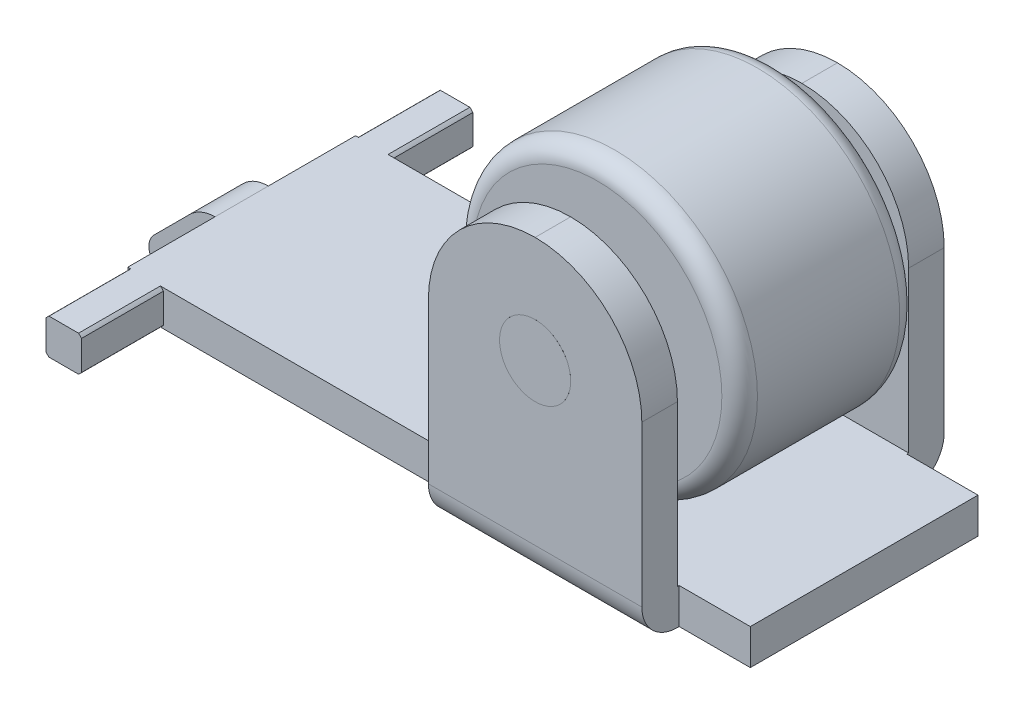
ISO-10303-21;
HEADER;
FILE_DESCRIPTION(('STEP AP214'),'2;1');
FILE_NAME('part.step','',(''),(''),'','','');
FILE_SCHEMA(('AUTOMOTIVE_DESIGN { 1 0 10303 214 1 1 1 1 }'));
ENDSEC;
DATA;
#1=APPLICATION_CONTEXT('core data for automotive mechanical design processes');
#2=APPLICATION_PROTOCOL_DEFINITION('international standard','automotive_design',2000,#1);
#3=PRODUCT_CONTEXT('',#1,'mechanical');
#4=PRODUCT('Part','Part','',(#3));
#5=PRODUCT_RELATED_PRODUCT_CATEGORY('part','',(#4));
#6=PRODUCT_DEFINITION_FORMATION('','',#4);
#7=PRODUCT_DEFINITION_CONTEXT('part definition',#1,'design');
#8=PRODUCT_DEFINITION('design','',#6,#7);
#9=PRODUCT_DEFINITION_SHAPE('','',#8);
#10=(LENGTH_UNIT() NAMED_UNIT(*) SI_UNIT(.MILLI.,.METRE.));
#11=(NAMED_UNIT(*) PLANE_ANGLE_UNIT() SI_UNIT($,.RADIAN.));
#12=(NAMED_UNIT(*) SI_UNIT($,.STERADIAN.) SOLID_ANGLE_UNIT());
#13=UNCERTAINTY_MEASURE_WITH_UNIT(LENGTH_MEASURE(1.E-05),#10,'distance_accuracy_value','');
#14=(GEOMETRIC_REPRESENTATION_CONTEXT(3) GLOBAL_UNCERTAINTY_ASSIGNED_CONTEXT((#13)) GLOBAL_UNIT_ASSIGNED_CONTEXT((#10,
#11,#12)) REPRESENTATION_CONTEXT('',''));
#15=CARTESIAN_POINT('',(0.,0.,0.));
#16=DIRECTION('',(0.,0.,1.));
#17=DIRECTION('',(1.,0.,0.));
#18=AXIS2_PLACEMENT_3D('',#15,#16,#17);
#19=CARTESIAN_POINT('',(12.,5.,2.5));
#20=DIRECTION('',(0.,0.,1.));
#21=DIRECTION('',(1.,0.,0.));
#22=AXIS2_PLACEMENT_3D('',#19,#20,#21);
#23=PLANE('',#22);
#24=CARTESIAN_POINT('',(12.,5.,2.5));
#25=DIRECTION('',(0.,0.,1.));
#26=DIRECTION('',(1.,0.,0.));
#27=AXIS2_PLACEMENT_3D('',#24,#25,#26);
#28=CIRCLE('',#27,3.50000000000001);
#29=CARTESIAN_POINT('',(15.5,5.,2.5));
#30=VERTEX_POINT('',#29);
#31=EDGE_CURVE('E58',#30,#30,#28,.T.);
#32=ORIENTED_EDGE('',*,*,#31,.T.);
#33=EDGE_LOOP('',(#32));
#34=FACE_BOUND('',#33,.T.);
#35=CARTESIAN_POINT('',(12.,5.,2.5));
#36=DIRECTION('',(0.,0.,1.));
#37=DIRECTION('',(1.,0.,0.));
#38=AXIS2_PLACEMENT_3D('',#35,#36,#37);
#39=CIRCLE('',#38,1.);
#40=CARTESIAN_POINT('',(13.,5.,2.5));
#41=VERTEX_POINT('',#40);
#42=EDGE_CURVE('E63',#41,#41,#39,.T.);
#43=ORIENTED_EDGE('',*,*,#42,.F.);
#44=EDGE_LOOP('',(#43));
#45=FACE_BOUND('',#44,.T.);
#46=ADVANCED_FACE('F43',(#34,#45),#23,.T.);
#47=CARTESIAN_POINT('',(12.,5.,-2.5));
#48=DIRECTION('',(0.,0.,1.));
#49=DIRECTION('',(1.,0.,0.));
#50=AXIS2_PLACEMENT_3D('',#47,#48,#49);
#51=PLANE('',#50);
#52=CARTESIAN_POINT('',(12.,5.,-2.5));
#53=DIRECTION('',(0.,0.,1.));
#54=DIRECTION('',(1.,0.,0.));
#55=AXIS2_PLACEMENT_3D('',#52,#53,#54);
#56=CIRCLE('',#55,3.50000000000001);
#57=CARTESIAN_POINT('',(15.5,5.,-2.5));
#58=VERTEX_POINT('',#57);
#59=EDGE_CURVE('E13',#58,#58,#56,.F.);
#60=ORIENTED_EDGE('',*,*,#59,.T.);
#61=EDGE_LOOP('',(#60));
#62=FACE_BOUND('',#61,.T.);
#63=CARTESIAN_POINT('',(12.,5.,-2.5));
#64=DIRECTION('',(0.,0.,1.));
#65=DIRECTION('',(1.,0.,0.));
#66=AXIS2_PLACEMENT_3D('',#63,#64,#65);
#67=CIRCLE('',#66,1.);
#68=CARTESIAN_POINT('',(13.,5.,-2.5));
#69=VERTEX_POINT('',#68);
#70=EDGE_CURVE('E64',#69,#69,#67,.T.);
#71=ORIENTED_EDGE('',*,*,#70,.T.);
#72=EDGE_LOOP('',(#71));
#73=FACE_BOUND('',#72,.T.);
#74=ADVANCED_FACE('F74',(#62,#73),#51,.F.);
#75=CARTESIAN_POINT('',(12.,5.,2.5));
#76=DIRECTION('',(0.,0.,-1.));
#77=DIRECTION('',(-1.,0.,0.));
#78=AXIS2_PLACEMENT_3D('',#75,#76,#77);
#79=CYLINDRICAL_SURFACE('',#78,4.00000000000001);
#80=CARTESIAN_POINT('',(12.,5.,2.));
#81=DIRECTION('',(0.,0.,1.));
#82=DIRECTION('',(1.,0.,0.));
#83=AXIS2_PLACEMENT_3D('',#80,#81,#82);
#84=CIRCLE('',#83,4.00000000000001);
#85=CARTESIAN_POINT('',(16.,5.,2.));
#86=VERTEX_POINT('',#85);
#87=EDGE_CURVE('E50',#86,#86,#84,.F.);
#88=ORIENTED_EDGE('',*,*,#87,.T.);
#89=EDGE_LOOP('',(#88));
#90=FACE_BOUND('',#89,.T.);
#91=CARTESIAN_POINT('',(12.,5.,-2.));
#92=DIRECTION('',(0.,0.,1.));
#93=DIRECTION('',(1.,0.,0.));
#94=AXIS2_PLACEMENT_3D('',#91,#92,#93);
#95=CIRCLE('',#94,4.00000000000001);
#96=CARTESIAN_POINT('',(16.,5.,-2.));
#97=VERTEX_POINT('',#96);
#98=EDGE_CURVE('E54',#97,#97,#95,.T.);
#99=ORIENTED_EDGE('',*,*,#98,.T.);
#100=EDGE_LOOP('',(#99));
#101=FACE_BOUND('',#100,.T.);
#102=ADVANCED_FACE('F80',(#90,#101),#79,.T.);
#103=CARTESIAN_POINT('',(12.,5.,2.5));
#104=DIRECTION('',(0.,0.,-1.));
#105=DIRECTION('',(-1.,0.,0.));
#106=AXIS2_PLACEMENT_3D('',#103,#104,#105);
#107=CYLINDRICAL_SURFACE('',#106,1.);
#108=ORIENTED_EDGE('',*,*,#42,.T.);
#109=EDGE_LOOP('',(#108));
#110=FACE_BOUND('',#109,.T.);
#111=ORIENTED_EDGE('',*,*,#70,.F.);
#112=EDGE_LOOP('',(#111));
#113=FACE_BOUND('',#112,.T.);
#114=ADVANCED_FACE('F70',(#110,#113),#107,.F.);
#115=CARTESIAN_POINT('',(12.,5.,2.));
#116=DIRECTION('',(0.,0.,1.));
#117=DIRECTION('',(1.,0.,0.));
#118=AXIS2_PLACEMENT_3D('',#115,#116,#117);
#119=TOROIDAL_SURFACE('',#118,3.50000000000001,0.5);
#120=ORIENTED_EDGE('',*,*,#87,.F.);
#121=EDGE_LOOP('',(#120));
#122=FACE_BOUND('',#121,.T.);
#123=ORIENTED_EDGE('',*,*,#31,.F.);
#124=EDGE_LOOP('',(#123));
#125=FACE_BOUND('',#124,.T.);
#126=ADVANCED_FACE('F85',(#122,#125),#119,.T.);
#127=CARTESIAN_POINT('',(12.,5.,-2.));
#128=DIRECTION('',(0.,0.,1.));
#129=DIRECTION('',(1.,0.,0.));
#130=AXIS2_PLACEMENT_3D('',#127,#128,#129);
#131=TOROIDAL_SURFACE('',#130,3.50000000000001,0.5);
#132=ORIENTED_EDGE('',*,*,#59,.F.);
#133=EDGE_LOOP('',(#132));
#134=FACE_BOUND('',#133,.T.);
#135=ORIENTED_EDGE('',*,*,#98,.F.);
#136=EDGE_LOOP('',(#135));
#137=FACE_BOUND('',#136,.T.);
#138=ADVANCED_FACE('F45',(#134,#137),#131,.T.);
#139=CLOSED_SHELL('',(#46,#74,#102,#114,#126,#138));
#140=MANIFOLD_SOLID_BREP('B2',#139);
#141=CARTESIAN_POINT('',(9.,8.,4.25));
#142=DIRECTION('',(0.,0.,1.));
#143=DIRECTION('',(0.,-1.,0.));
#144=AXIS2_PLACEMENT_3D('',#141,#142,#143);
#145=PLANE('',#144);
#146=CARTESIAN_POINT('',(12.,5.,4.25));
#147=DIRECTION('',(0.,0.,1.));
#148=DIRECTION('',(0.,-1.,0.));
#149=AXIS2_PLACEMENT_3D('',#146,#147,#148);
#150=CIRCLE('',#149,1.);
#151=CARTESIAN_POINT('',(12.,3.99999999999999,4.25));
#152=VERTEX_POINT('',#151);
#153=EDGE_CURVE('E42',#152,#152,#150,.F.);
#154=ORIENTED_EDGE('',*,*,#153,.F.);
#155=EDGE_LOOP('',(#154));
#156=FACE_BOUND('',#155,.T.);
#157=ADVANCED_FACE('F144',(#156),#145,.T.);
#158=CARTESIAN_POINT('',(12.,5.,-4.25));
#159=DIRECTION('',(0.,0.,-1.));
#160=DIRECTION('',(0.,1.,0.));
#161=AXIS2_PLACEMENT_3D('',#158,#159,#160);
#162=PLANE('',#161);
#163=CARTESIAN_POINT('',(12.,5.,-4.25));
#164=DIRECTION('',(0.,0.,-1.));
#165=DIRECTION('',(0.,1.,0.));
#166=AXIS2_PLACEMENT_3D('',#163,#164,#165);
#167=CIRCLE('',#166,1.);
#168=CARTESIAN_POINT('',(12.,6.,-4.25));
#169=VERTEX_POINT('',#168);
#170=EDGE_CURVE('E150',#169,#169,#167,.T.);
#171=ORIENTED_EDGE('',*,*,#170,.T.);
#172=EDGE_LOOP('',(#171));
#173=FACE_BOUND('',#172,.T.);
#174=ADVANCED_FACE('F156',(#173),#162,.T.);
#175=CARTESIAN_POINT('',(12.,5.,7.07842712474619));
#176=DIRECTION('',(0.,0.,-1.));
#177=DIRECTION('',(0.,1.,0.));
#178=AXIS2_PLACEMENT_3D('',#175,#176,#177);
#179=CYLINDRICAL_SURFACE('',#178,1.);
#180=ORIENTED_EDGE('',*,*,#170,.F.);
#181=EDGE_LOOP('',(#180));
#182=FACE_BOUND('',#181,.T.);
#183=ORIENTED_EDGE('',*,*,#153,.T.);
#184=EDGE_LOOP('',(#183));
#185=FACE_BOUND('',#184,.T.);
#186=ADVANCED_FACE('F158',(#182,#185),#179,.T.);
#187=CLOSED_SHELL('',(#157,#174,#186));
#188=MANIFOLD_SOLID_BREP('B8',#187);
#189=CARTESIAN_POINT('',(17.,-0.5,-3.2));
#190=DIRECTION('',(0.,0.,-1.));
#191=DIRECTION('',(-1.,0.,0.));
#192=AXIS2_PLACEMENT_3D('',#189,#190,#191);
#193=PLANE('',#192);
#194=DIRECTION('',(1.,0.,0.));
#195=VECTOR('',#194,1.);
#196=CARTESIAN_POINT('',(-0.5,-0.5,-3.2));
#197=LINE('',#196,#195);
#198=CARTESIAN_POINT('',(15.,-0.5,-3.2));
#199=VERTEX_POINT('',#198);
#200=CARTESIAN_POINT('',(17.,-0.5,-3.2));
#201=VERTEX_POINT('',#200);
#202=EDGE_CURVE('E480',#199,#201,#197,.T.);
#203=ORIENTED_EDGE('',*,*,#202,.F.);
#204=DIRECTION('',(0.,-1.,0.));
#205=VECTOR('',#204,1.);
#206=CARTESIAN_POINT('',(15.,0.5,-3.2));
#207=LINE('',#206,#205);
#208=CARTESIAN_POINT('',(15.,0.5,-3.2));
#209=VERTEX_POINT('',#208);
#210=EDGE_CURVE('E1324',#209,#199,#207,.T.);
#211=ORIENTED_EDGE('',*,*,#210,.F.);
#212=DIRECTION('',(-1.,0.,0.));
#213=VECTOR('',#212,1.);
#214=CARTESIAN_POINT('',(0.,0.5,-3.2));
#215=LINE('',#214,#213);
#216=CARTESIAN_POINT('',(17.,0.5,-3.2));
#217=VERTEX_POINT('',#216);
#218=EDGE_CURVE('E476',#217,#209,#215,.T.);
#219=ORIENTED_EDGE('',*,*,#218,.F.);
#220=DIRECTION('',(0.,1.,0.));
#221=VECTOR('',#220,1.);
#222=CARTESIAN_POINT('',(17.,0.5,-3.2));
#223=LINE('',#222,#221);
#224=EDGE_CURVE('E477',#201,#217,#223,.T.);
#225=ORIENTED_EDGE('',*,*,#224,.F.);
#226=EDGE_LOOP('',(#203,#211,#219,#225));
#227=FACE_BOUND('',#226,.T.);
#228=ADVANCED_FACE('F185',(#227),#193,.T.);
#229=CARTESIAN_POINT('',(17.,-0.5,3.2));
#230=DIRECTION('',(0.,0.,-1.));
#231=DIRECTION('',(-1.,0.,0.));
#232=AXIS2_PLACEMENT_3D('',#229,#230,#231);
#233=PLANE('',#232);
#234=DIRECTION('',(0.,1.,0.));
#235=VECTOR('',#234,1.);
#236=CARTESIAN_POINT('',(9.,0.5,3.2));
#237=LINE('',#236,#235);
#238=CARTESIAN_POINT('',(9.,-0.5,3.2));
#239=VERTEX_POINT('',#238);
#240=CARTESIAN_POINT('',(9.,0.5,3.2));
#241=VERTEX_POINT('',#240);
#242=EDGE_CURVE('E626',#239,#241,#237,.T.);
#243=ORIENTED_EDGE('',*,*,#242,.T.);
#244=DIRECTION('',(-1.,0.,0.));
#245=VECTOR('',#244,1.);
#246=CARTESIAN_POINT('',(0.,0.5,3.2));
#247=LINE('',#246,#245);
#248=CARTESIAN_POINT('',(0.415331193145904,0.5,3.2));
#249=VERTEX_POINT('',#248);
#250=EDGE_CURVE('E677',#241,#249,#247,.T.);
#251=ORIENTED_EDGE('',*,*,#250,.T.);
#252=CARTESIAN_POINT('',(0.,0.,3.2));
#253=DIRECTION('',(0.,0.,-1.));
#254=DIRECTION('',(-1.,0.,0.));
#255=AXIS2_PLACEMENT_3D('',#252,#253,#254);
#256=CIRCLE('',#255,0.65);
#257=CARTESIAN_POINT('',(0.5,0.415331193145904,3.2));
#258=VERTEX_POINT('',#257);
#259=EDGE_CURVE('E926',#258,#249,#256,.F.);
#260=ORIENTED_EDGE('',*,*,#259,.F.);
#261=DIRECTION('',(0.,1.,0.));
#262=VECTOR('',#261,1.);
#263=CARTESIAN_POINT('',(0.5,-0.500000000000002,3.2));
#264=LINE('',#263,#262);
#265=CARTESIAN_POINT('',(0.5,-0.415331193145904,3.2));
#266=VERTEX_POINT('',#265);
#267=EDGE_CURVE('E482',#266,#258,#264,.T.);
#268=ORIENTED_EDGE('',*,*,#267,.F.);
#269=CARTESIAN_POINT('',(0.415331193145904,-0.5,3.2));
#270=VERTEX_POINT('',#269);
#271=EDGE_CURVE('E736',#270,#266,#256,.F.);
#272=ORIENTED_EDGE('',*,*,#271,.F.);
#273=DIRECTION('',(1.,0.,0.));
#274=VECTOR('',#273,1.);
#275=CARTESIAN_POINT('',(0.,-0.5,3.2));
#276=LINE('',#275,#274);
#277=EDGE_CURVE('E666',#270,#239,#276,.T.);
#278=ORIENTED_EDGE('',*,*,#277,.T.);
#279=EDGE_LOOP('',(#243,#251,#260,#268,#272,#278));
#280=FACE_BOUND('',#279,.T.);
#281=ADVANCED_FACE('F876',(#280),#233,.F.);
#282=CARTESIAN_POINT('',(-0.5,0.5,3.2));
#283=DIRECTION('',(1.,0.,0.));
#284=DIRECTION('',(0.,0.,-1.));
#285=AXIS2_PLACEMENT_3D('',#282,#283,#284);
#286=PLANE('',#285);
#287=DIRECTION('',(0.,1.,0.));
#288=VECTOR('',#287,1.);
#289=CARTESIAN_POINT('',(-0.5,0.5,0.75));
#290=LINE('',#289,#288);
#291=CARTESIAN_POINT('',(-0.5,-0.5,0.75));
#292=VERTEX_POINT('',#291);
#293=CARTESIAN_POINT('',(-0.5,0.5,0.75));
#294=VERTEX_POINT('',#293);
#295=EDGE_CURVE('E530',#292,#294,#290,.T.);
#296=ORIENTED_EDGE('',*,*,#295,.F.);
#297=DIRECTION('',(0.,0.,-1.));
#298=VECTOR('',#297,1.);
#299=CARTESIAN_POINT('',(-0.5,-0.5,3.2));
#300=LINE('',#299,#298);
#301=CARTESIAN_POINT('',(-0.5,-0.5,3.2));
#302=VERTEX_POINT('',#301);
#303=EDGE_CURVE('E498',#302,#292,#300,.T.);
#304=ORIENTED_EDGE('',*,*,#303,.F.);
#305=DIRECTION('',(0.,1.,0.));
#306=VECTOR('',#305,1.);
#307=CARTESIAN_POINT('',(-0.5,0.5,3.2));
#308=LINE('',#307,#306);
#309=CARTESIAN_POINT('',(-0.5,-0.415331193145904,3.2));
#310=VERTEX_POINT('',#309);
#311=EDGE_CURVE('E708',#302,#310,#308,.T.);
#312=ORIENTED_EDGE('',*,*,#311,.T.);
#313=DIRECTION('',(0.,0.,1.));
#314=VECTOR('',#313,1.);
#315=CARTESIAN_POINT('',(-0.5,-0.415331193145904,-14.6813898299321));
#316=LINE('',#315,#314);
#317=CARTESIAN_POINT('',(-0.5,-0.415331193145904,5.5));
#318=VERTEX_POINT('',#317);
#319=EDGE_CURVE('E723',#318,#310,#316,.F.);
#320=ORIENTED_EDGE('',*,*,#319,.F.);
#321=DIRECTION('',(0.,-1.,0.));
#322=VECTOR('',#321,1.);
#323=CARTESIAN_POINT('',(-0.5,0.5,5.5));
#324=LINE('',#323,#322);
#325=CARTESIAN_POINT('',(-0.5,0.415331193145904,5.5));
#326=VERTEX_POINT('',#325);
#327=EDGE_CURVE('E703',#326,#318,#324,.T.);
#328=ORIENTED_EDGE('',*,*,#327,.F.);
#329=DIRECTION('',(0.,0.,1.));
#330=VECTOR('',#329,1.);
#331=CARTESIAN_POINT('',(-0.5,0.415331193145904,-14.6813898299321));
#332=LINE('',#331,#330);
#333=CARTESIAN_POINT('',(-0.5,0.415331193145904,3.2));
#334=VERTEX_POINT('',#333);
#335=EDGE_CURVE('E721',#334,#326,#332,.T.);
#336=ORIENTED_EDGE('',*,*,#335,.F.);
#337=CARTESIAN_POINT('',(-0.5,0.5,3.2));
#338=VERTEX_POINT('',#337);
#339=EDGE_CURVE('E711',#334,#338,#308,.T.);
#340=ORIENTED_EDGE('',*,*,#339,.T.);
#341=DIRECTION('',(0.,0.,-1.));
#342=VECTOR('',#341,1.);
#343=CARTESIAN_POINT('',(-0.5,0.5,3.2));
#344=LINE('',#343,#342);
#345=EDGE_CURVE('E518',#338,#294,#344,.T.);
#346=ORIENTED_EDGE('',*,*,#345,.T.);
#347=EDGE_LOOP('',(#296,#304,#312,#320,#328,#336,#340,#346));
#348=FACE_BOUND('',#347,.T.);
#349=ADVANCED_FACE('F815',(#348),#286,.F.);
#350=CARTESIAN_POINT('',(0.,0.5,3.2));
#351=DIRECTION('',(0.,-1.,0.));
#352=DIRECTION('',(0.,0.,-1.));
#353=AXIS2_PLACEMENT_3D('',#350,#351,#352);
#354=PLANE('',#353);
#355=DIRECTION('',(0.,0.,-1.));
#356=VECTOR('',#355,1.);
#357=CARTESIAN_POINT('',(-0.415331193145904,0.5,14.6813898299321));
#358=LINE('',#357,#356);
#359=CARTESIAN_POINT('',(-0.415331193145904,0.5,-3.2));
#360=VERTEX_POINT('',#359);
#361=CARTESIAN_POINT('',(-0.415331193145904,0.5,-5.5));
#362=VERTEX_POINT('',#361);
#363=EDGE_CURVE('E741',#360,#362,#358,.T.);
#364=ORIENTED_EDGE('',*,*,#363,.F.);
#365=DIRECTION('',(1.,0.,0.));
#366=VECTOR('',#365,1.);
#367=CARTESIAN_POINT('',(0.,0.5,-3.2));
#368=LINE('',#367,#366);
#369=CARTESIAN_POINT('',(-0.5,0.5,-3.2));
#370=VERTEX_POINT('',#369);
#371=EDGE_CURVE('E753',#370,#360,#368,.T.);
#372=ORIENTED_EDGE('',*,*,#371,.F.);
#373=CARTESIAN_POINT('',(-0.5,0.5,-0.75));
#374=VERTEX_POINT('',#373);
#375=EDGE_CURVE('E501',#374,#370,#344,.T.);
#376=ORIENTED_EDGE('',*,*,#375,.F.);
#377=DIRECTION('',(0.,0.,-1.));
#378=VECTOR('',#377,1.);
#379=CARTESIAN_POINT('',(-0.5,0.5,0.75));
#380=LINE('',#379,#378);
#381=EDGE_CURVE('E537',#294,#374,#380,.T.);
#382=ORIENTED_EDGE('',*,*,#381,.F.);
#383=ORIENTED_EDGE('',*,*,#345,.F.);
#384=DIRECTION('',(1.,0.,0.));
#385=VECTOR('',#384,1.);
#386=CARTESIAN_POINT('',(0.,0.5,3.2));
#387=LINE('',#386,#385);
#388=CARTESIAN_POINT('',(-0.415331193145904,0.5,3.2));
#389=VERTEX_POINT('',#388);
#390=EDGE_CURVE('E697',#338,#389,#387,.T.);
#391=ORIENTED_EDGE('',*,*,#390,.T.);
#392=DIRECTION('',(0.,0.,1.));
#393=VECTOR('',#392,1.);
#394=CARTESIAN_POINT('',(-0.415331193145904,0.5,-14.6813898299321));
#395=LINE('',#394,#393);
#396=CARTESIAN_POINT('',(-0.415331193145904,0.5,5.5));
#397=VERTEX_POINT('',#396);
#398=EDGE_CURVE('E719',#397,#389,#395,.F.);
#399=ORIENTED_EDGE('',*,*,#398,.F.);
#400=DIRECTION('',(-1.,0.,0.));
#401=VECTOR('',#400,1.);
#402=CARTESIAN_POINT('',(-0.5,0.5,5.5));
#403=LINE('',#402,#401);
#404=CARTESIAN_POINT('',(0.415331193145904,0.5,5.5));
#405=VERTEX_POINT('',#404);
#406=EDGE_CURVE('E687',#405,#397,#403,.T.);
#407=ORIENTED_EDGE('',*,*,#406,.F.);
#408=DIRECTION('',(0.,0.,1.));
#409=VECTOR('',#408,1.);
#410=CARTESIAN_POINT('',(0.415331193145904,0.5,-14.6813898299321));
#411=LINE('',#410,#409);
#412=EDGE_CURVE('E717',#249,#405,#411,.T.);
#413=ORIENTED_EDGE('',*,*,#412,.F.);
#414=ORIENTED_EDGE('',*,*,#250,.F.);
#415=DIRECTION('',(0.,0.,1.));
#416=VECTOR('',#415,1.);
#417=CARTESIAN_POINT('',(9.,0.5,3.2));
#418=LINE('',#417,#416);
#419=CARTESIAN_POINT('',(9.,0.5,3.25));
#420=VERTEX_POINT('',#419);
#421=EDGE_CURVE('E625',#241,#420,#418,.T.);
#422=ORIENTED_EDGE('',*,*,#421,.T.);
#423=DIRECTION('',(1.,0.,0.));
#424=VECTOR('',#423,1.);
#425=CARTESIAN_POINT('',(9.,0.5,3.25));
#426=LINE('',#425,#424);
#427=CARTESIAN_POINT('',(15.,0.5,3.25));
#428=VERTEX_POINT('',#427);
#429=EDGE_CURVE('E542',#420,#428,#426,.T.);
#430=ORIENTED_EDGE('',*,*,#429,.T.);
#431=DIRECTION('',(0.,0.,1.));
#432=VECTOR('',#431,1.);
#433=CARTESIAN_POINT('',(15.,0.5,3.2));
#434=LINE('',#433,#432);
#435=CARTESIAN_POINT('',(15.,0.5,3.2));
#436=VERTEX_POINT('',#435);
#437=EDGE_CURVE('E617',#436,#428,#434,.T.);
#438=ORIENTED_EDGE('',*,*,#437,.F.);
#439=CARTESIAN_POINT('',(17.,0.5,3.2));
#440=VERTEX_POINT('',#439);
#441=EDGE_CURVE('E675',#440,#436,#247,.T.);
#442=ORIENTED_EDGE('',*,*,#441,.F.);
#443=DIRECTION('',(0.,0.,-1.));
#444=VECTOR('',#443,1.);
#445=CARTESIAN_POINT('',(17.,0.5,3.2));
#446=LINE('',#445,#444);
#447=EDGE_CURVE('E516',#440,#217,#446,.T.);
#448=ORIENTED_EDGE('',*,*,#447,.T.);
#449=ORIENTED_EDGE('',*,*,#218,.T.);
#450=DIRECTION('',(0.,0.,1.));
#451=VECTOR('',#450,1.);
#452=CARTESIAN_POINT('',(15.,0.5,-3.2));
#453=LINE('',#452,#451);
#454=CARTESIAN_POINT('',(15.,0.5,-3.25));
#455=VERTEX_POINT('',#454);
#456=EDGE_CURVE('E1327',#455,#209,#453,.T.);
#457=ORIENTED_EDGE('',*,*,#456,.F.);
#458=DIRECTION('',(1.,0.,0.));
#459=VECTOR('',#458,1.);
#460=CARTESIAN_POINT('',(9.,0.5,-3.25));
#461=LINE('',#460,#459);
#462=CARTESIAN_POINT('',(9.,0.5,-3.25));
#463=VERTEX_POINT('',#462);
#464=EDGE_CURVE('E469',#463,#455,#461,.T.);
#465=ORIENTED_EDGE('',*,*,#464,.F.);
#466=DIRECTION('',(0.,0.,1.));
#467=VECTOR('',#466,1.);
#468=CARTESIAN_POINT('',(9.,0.5,-3.2));
#469=LINE('',#468,#467);
#470=CARTESIAN_POINT('',(9.,0.5,-3.2));
#471=VERTEX_POINT('',#470);
#472=EDGE_CURVE('E452',#463,#471,#469,.T.);
#473=ORIENTED_EDGE('',*,*,#472,.T.);
#474=CARTESIAN_POINT('',(0.415331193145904,0.5,-3.2));
#475=VERTEX_POINT('',#474);
#476=EDGE_CURVE('E465',#471,#475,#215,.T.);
#477=ORIENTED_EDGE('',*,*,#476,.T.);
#478=DIRECTION('',(0.,0.,-1.));
#479=VECTOR('',#478,1.);
#480=CARTESIAN_POINT('',(0.415331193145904,0.5,14.6813898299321));
#481=LINE('',#480,#479);
#482=CARTESIAN_POINT('',(0.415331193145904,0.5,-5.5));
#483=VERTEX_POINT('',#482);
#484=EDGE_CURVE('E743',#483,#475,#481,.F.);
#485=ORIENTED_EDGE('',*,*,#484,.F.);
#486=DIRECTION('',(-1.,0.,0.));
#487=VECTOR('',#486,1.);
#488=CARTESIAN_POINT('',(-0.5,0.5,-5.5));
#489=LINE('',#488,#487);
#490=EDGE_CURVE('E694',#483,#362,#489,.T.);
#491=ORIENTED_EDGE('',*,*,#490,.T.);
#492=EDGE_LOOP('',(#364,#372,#376,#382,#383,#391,#399,#407,#413,#414,#422,#430,#438,#442,#448,
#449,#457,#465,#473,#477,#485,#491));
#493=FACE_BOUND('',#492,.T.);
#494=ADVANCED_FACE('F463',(#493),#354,.F.);
#495=CARTESIAN_POINT('',(-0.5,-0.5,-0.75));
#496=VERTEX_POINT('',#495);
#497=CARTESIAN_POINT('',(-0.5,-0.5,-3.2));
#498=VERTEX_POINT('',#497);
#499=EDGE_CURVE('E495',#496,#498,#300,.T.);
#500=ORIENTED_EDGE('',*,*,#499,.F.);
#501=DIRECTION('',(0.,1.,0.));
#502=VECTOR('',#501,1.);
#503=CARTESIAN_POINT('',(-0.5,0.5,-0.75));
#504=LINE('',#503,#502);
#505=EDGE_CURVE('E553',#496,#374,#504,.T.);
#506=ORIENTED_EDGE('',*,*,#505,.T.);
#507=ORIENTED_EDGE('',*,*,#375,.T.);
#508=DIRECTION('',(0.,1.,0.));
#509=VECTOR('',#508,1.);
#510=CARTESIAN_POINT('',(-0.5,0.5,-3.2));
#511=LINE('',#510,#509);
#512=CARTESIAN_POINT('',(-0.5,0.415331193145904,-3.2));
#513=VERTEX_POINT('',#512);
#514=EDGE_CURVE('E756',#513,#370,#511,.T.);
#515=ORIENTED_EDGE('',*,*,#514,.F.);
#516=DIRECTION('',(0.,0.,-1.));
#517=VECTOR('',#516,1.);
#518=CARTESIAN_POINT('',(-0.5,0.415331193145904,14.6813898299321));
#519=LINE('',#518,#517);
#520=CARTESIAN_POINT('',(-0.5,0.415331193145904,-5.5));
#521=VERTEX_POINT('',#520);
#522=EDGE_CURVE('E747',#521,#513,#519,.F.);
#523=ORIENTED_EDGE('',*,*,#522,.F.);
#524=DIRECTION('',(0.,-1.,0.));
#525=VECTOR('',#524,1.);
#526=CARTESIAN_POINT('',(-0.5,0.5,-5.5));
#527=LINE('',#526,#525);
#528=CARTESIAN_POINT('',(-0.5,-0.415331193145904,-5.5));
#529=VERTEX_POINT('',#528);
#530=EDGE_CURVE('E691',#521,#529,#527,.T.);
#531=ORIENTED_EDGE('',*,*,#530,.T.);
#532=DIRECTION('',(0.,0.,-1.));
#533=VECTOR('',#532,1.);
#534=CARTESIAN_POINT('',(-0.5,-0.415331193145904,14.6813898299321));
#535=LINE('',#534,#533);
#536=CARTESIAN_POINT('',(-0.5,-0.415331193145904,-3.2));
#537=VERTEX_POINT('',#536);
#538=EDGE_CURVE('E745',#537,#529,#535,.T.);
#539=ORIENTED_EDGE('',*,*,#538,.F.);
#540=EDGE_CURVE('E754',#498,#537,#511,.T.);
#541=ORIENTED_EDGE('',*,*,#540,.F.);
#542=EDGE_LOOP('',(#500,#506,#507,#515,#523,#531,#539,#541));
#543=FACE_BOUND('',#542,.T.);
#544=ADVANCED_FACE('F851',(#543),#286,.F.);
#545=CARTESIAN_POINT('',(-0.5,-0.5,3.2));
#546=DIRECTION('',(0.,1.,0.));
#547=DIRECTION('',(0.,0.,1.));
#548=AXIS2_PLACEMENT_3D('',#545,#546,#547);
#549=PLANE('',#548);
#550=DIRECTION('',(0.,0.,-1.));
#551=VECTOR('',#550,1.);
#552=CARTESIAN_POINT('',(0.415331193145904,-0.5,14.6813898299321));
#553=LINE('',#552,#551);
#554=CARTESIAN_POINT('',(0.415331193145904,-0.5,-3.2));
#555=VERTEX_POINT('',#554);
#556=CARTESIAN_POINT('',(0.415331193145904,-0.5,-5.5));
#557=VERTEX_POINT('',#556);
#558=EDGE_CURVE('E749',#555,#557,#553,.T.);
#559=ORIENTED_EDGE('',*,*,#558,.F.);
#560=CARTESIAN_POINT('',(9.,-0.5,-3.2));
#561=VERTEX_POINT('',#560);
#562=EDGE_CURVE('E486',#555,#561,#197,.T.);
#563=ORIENTED_EDGE('',*,*,#562,.T.);
#564=DIRECTION('',(0.,0.,-1.));
#565=VECTOR('',#564,1.);
#566=CARTESIAN_POINT('',(9.,-0.5,-3.25));
#567=LINE('',#566,#565);
#568=CARTESIAN_POINT('',(9.,-0.5,-3.25));
#569=VERTEX_POINT('',#568);
#570=EDGE_CURVE('E455',#561,#569,#567,.T.);
#571=ORIENTED_EDGE('',*,*,#570,.T.);
#572=DIRECTION('',(1.,0.,0.));
#573=VECTOR('',#572,1.);
#574=CARTESIAN_POINT('',(9.,-0.5,-3.25));
#575=LINE('',#574,#573);
#576=CARTESIAN_POINT('',(15.,-0.5,-3.25));
#577=VERTEX_POINT('',#576);
#578=EDGE_CURVE('E642',#569,#577,#575,.T.);
#579=ORIENTED_EDGE('',*,*,#578,.T.);
#580=DIRECTION('',(0.,0.,-1.));
#581=VECTOR('',#580,1.);
#582=CARTESIAN_POINT('',(15.,-0.5,-3.25));
#583=LINE('',#582,#581);
#584=EDGE_CURVE('E1320',#199,#577,#583,.T.);
#585=ORIENTED_EDGE('',*,*,#584,.F.);
#586=ORIENTED_EDGE('',*,*,#202,.T.);
#587=DIRECTION('',(0.,0.,-1.));
#588=VECTOR('',#587,1.);
#589=CARTESIAN_POINT('',(17.,-0.5,3.2));
#590=LINE('',#589,#588);
#591=CARTESIAN_POINT('',(17.,-0.5,3.2));
#592=VERTEX_POINT('',#591);
#593=EDGE_CURVE('E514',#592,#201,#590,.T.);
#594=ORIENTED_EDGE('',*,*,#593,.F.);
#595=CARTESIAN_POINT('',(15.,-0.5,3.2));
#596=VERTEX_POINT('',#595);
#597=EDGE_CURVE('E488',#596,#592,#276,.T.);
#598=ORIENTED_EDGE('',*,*,#597,.F.);
#599=DIRECTION('',(0.,0.,-1.));
#600=VECTOR('',#599,1.);
#601=CARTESIAN_POINT('',(15.,-0.5,3.25));
#602=LINE('',#601,#600);
#603=CARTESIAN_POINT('',(15.,-0.5,3.25));
#604=VERTEX_POINT('',#603);
#605=EDGE_CURVE('E615',#604,#596,#602,.T.);
#606=ORIENTED_EDGE('',*,*,#605,.F.);
#607=DIRECTION('',(1.,0.,0.));
#608=VECTOR('',#607,1.);
#609=CARTESIAN_POINT('',(9.,-0.5,3.25));
#610=LINE('',#609,#608);
#611=CARTESIAN_POINT('',(9.,-0.5,3.25));
#612=VERTEX_POINT('',#611);
#613=EDGE_CURVE('E557',#612,#604,#610,.T.);
#614=ORIENTED_EDGE('',*,*,#613,.F.);
#615=DIRECTION('',(0.,0.,-1.));
#616=VECTOR('',#615,1.);
#617=CARTESIAN_POINT('',(9.,-0.5,3.25));
#618=LINE('',#617,#616);
#619=EDGE_CURVE('E629',#612,#239,#618,.T.);
#620=ORIENTED_EDGE('',*,*,#619,.T.);
#621=ORIENTED_EDGE('',*,*,#277,.F.);
#622=DIRECTION('',(0.,0.,1.));
#623=VECTOR('',#622,1.);
#624=CARTESIAN_POINT('',(0.415331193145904,-0.5,-14.6813898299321));
#625=LINE('',#624,#623);
#626=CARTESIAN_POINT('',(0.415331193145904,-0.5,5.5));
#627=VERTEX_POINT('',#626);
#628=EDGE_CURVE('E727',#627,#270,#625,.F.);
#629=ORIENTED_EDGE('',*,*,#628,.F.);
#630=DIRECTION('',(1.,0.,0.));
#631=VECTOR('',#630,1.);
#632=CARTESIAN_POINT('',(-0.5,-0.5,5.5));
#633=LINE('',#632,#631);
#634=CARTESIAN_POINT('',(-0.415331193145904,-0.5,5.5));
#635=VERTEX_POINT('',#634);
#636=EDGE_CURVE('E700',#635,#627,#633,.T.);
#637=ORIENTED_EDGE('',*,*,#636,.F.);
#638=DIRECTION('',(0.,0.,1.));
#639=VECTOR('',#638,1.);
#640=CARTESIAN_POINT('',(-0.415331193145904,-0.5,-14.6813898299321));
#641=LINE('',#640,#639);
#642=CARTESIAN_POINT('',(-0.415331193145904,-0.5,3.2));
#643=VERTEX_POINT('',#642);
#644=EDGE_CURVE('E725',#643,#635,#641,.T.);
#645=ORIENTED_EDGE('',*,*,#644,.F.);
#646=DIRECTION('',(-1.,0.,0.));
#647=VECTOR('',#646,1.);
#648=CARTESIAN_POINT('',(-0.5,-0.5,3.2));
#649=LINE('',#648,#647);
#650=EDGE_CURVE('E712',#643,#302,#649,.T.);
#651=ORIENTED_EDGE('',*,*,#650,.T.);
#652=ORIENTED_EDGE('',*,*,#303,.T.);
#653=DIRECTION('',(0.,0.,-1.));
#654=VECTOR('',#653,1.);
#655=CARTESIAN_POINT('',(-0.5,-0.5,0.75));
#656=LINE('',#655,#654);
#657=EDGE_CURVE('E779',#292,#496,#656,.T.);
#658=ORIENTED_EDGE('',*,*,#657,.T.);
#659=ORIENTED_EDGE('',*,*,#499,.T.);
#660=DIRECTION('',(-1.,0.,0.));
#661=VECTOR('',#660,1.);
#662=CARTESIAN_POINT('',(-0.5,-0.5,-3.2));
#663=LINE('',#662,#661);
#664=CARTESIAN_POINT('',(-0.415331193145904,-0.5,-3.2));
#665=VERTEX_POINT('',#664);
#666=EDGE_CURVE('E757',#665,#498,#663,.T.);
#667=ORIENTED_EDGE('',*,*,#666,.F.);
#668=DIRECTION('',(0.,0.,-1.));
#669=VECTOR('',#668,1.);
#670=CARTESIAN_POINT('',(-0.415331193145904,-0.5,14.6813898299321));
#671=LINE('',#670,#669);
#672=CARTESIAN_POINT('',(-0.415331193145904,-0.5,-5.5));
#673=VERTEX_POINT('',#672);
#674=EDGE_CURVE('E751',#673,#665,#671,.F.);
#675=ORIENTED_EDGE('',*,*,#674,.F.);
#676=DIRECTION('',(1.,0.,0.));
#677=VECTOR('',#676,1.);
#678=CARTESIAN_POINT('',(-0.5,-0.5,-5.5));
#679=LINE('',#678,#677);
#680=EDGE_CURVE('E688',#673,#557,#679,.T.);
#681=ORIENTED_EDGE('',*,*,#680,.T.);
#682=EDGE_LOOP('',(#559,#563,#571,#579,#585,#586,#594,#598,#606,#614,#620,#621,#629,#637,#645,
#651,#652,#658,#659,#667,#675,#681));
#683=FACE_BOUND('',#682,.T.);
#684=ADVANCED_FACE('F664',(#683),#549,.F.);
#685=CARTESIAN_POINT('',(0.5,0.5,-5.5));
#686=DIRECTION('',(0.,0.,-1.));
#687=DIRECTION('',(-1.,0.,0.));
#688=AXIS2_PLACEMENT_3D('',#685,#686,#687);
#689=PLANE('',#688);
#690=ORIENTED_EDGE('',*,*,#530,.F.);
#691=CARTESIAN_POINT('',(0.,0.,-5.5));
#692=DIRECTION('',(0.,0.,-1.));
#693=DIRECTION('',(-1.,0.,0.));
#694=AXIS2_PLACEMENT_3D('',#691,#692,#693);
#695=CIRCLE('',#694,0.65);
#696=EDGE_CURVE('E766',#521,#362,#695,.T.);
#697=ORIENTED_EDGE('',*,*,#696,.T.);
#698=ORIENTED_EDGE('',*,*,#490,.F.);
#699=CARTESIAN_POINT('',(0.5,0.415331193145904,-5.5));
#700=VERTEX_POINT('',#699);
#701=EDGE_CURVE('E769',#483,#700,#695,.T.);
#702=ORIENTED_EDGE('',*,*,#701,.T.);
#703=DIRECTION('',(0.,1.,0.));
#704=VECTOR('',#703,1.);
#705=CARTESIAN_POINT('',(0.5,0.5,-5.5));
#706=LINE('',#705,#704);
#707=CARTESIAN_POINT('',(0.5,-0.415331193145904,-5.5));
#708=VERTEX_POINT('',#707);
#709=EDGE_CURVE('E684',#708,#700,#706,.T.);
#710=ORIENTED_EDGE('',*,*,#709,.F.);
#711=EDGE_CURVE('E824',#708,#557,#695,.T.);
#712=ORIENTED_EDGE('',*,*,#711,.T.);
#713=ORIENTED_EDGE('',*,*,#680,.F.);
#714=EDGE_CURVE('E770',#673,#529,#695,.T.);
#715=ORIENTED_EDGE('',*,*,#714,.T.);
#716=EDGE_LOOP('',(#690,#697,#698,#702,#710,#712,#713,#715));
#717=FACE_BOUND('',#716,.T.);
#718=ADVANCED_FACE('F832',(#717),#689,.T.);
#719=CARTESIAN_POINT('',(0.5,0.5,5.5));
#720=DIRECTION('',(-1.,0.,0.));
#721=DIRECTION('',(0.,-1.,0.));
#722=AXIS2_PLACEMENT_3D('',#719,#720,#721);
#723=PLANE('',#722);
#724=DIRECTION('',(0.,0.,-1.));
#725=VECTOR('',#724,1.);
#726=CARTESIAN_POINT('',(0.5,0.415331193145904,14.6813898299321));
#727=LINE('',#726,#725);
#728=CARTESIAN_POINT('',(0.5,0.415331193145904,-3.2));
#729=VERTEX_POINT('',#728);
#730=EDGE_CURVE('E502',#729,#700,#727,.T.);
#731=ORIENTED_EDGE('',*,*,#730,.F.);
#732=DIRECTION('',(0.,1.,0.));
#733=VECTOR('',#732,1.);
#734=CARTESIAN_POINT('',(0.5,-0.500000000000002,-3.2));
#735=LINE('',#734,#733);
#736=CARTESIAN_POINT('',(0.5,-0.415331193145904,-3.2));
#737=VERTEX_POINT('',#736);
#738=EDGE_CURVE('E512',#737,#729,#735,.T.);
#739=ORIENTED_EDGE('',*,*,#738,.F.);
#740=DIRECTION('',(0.,0.,-1.));
#741=VECTOR('',#740,1.);
#742=CARTESIAN_POINT('',(0.5,-0.415331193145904,14.6813898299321));
#743=LINE('',#742,#741);
#744=EDGE_CURVE('E505',#708,#737,#743,.F.);
#745=ORIENTED_EDGE('',*,*,#744,.F.);
#746=ORIENTED_EDGE('',*,*,#709,.T.);
#747=EDGE_LOOP('',(#731,#739,#745,#746));
#748=FACE_BOUND('',#747,.T.);
#749=ADVANCED_FACE('F837',(#748),#723,.F.);
#750=DIRECTION('',(0.,0.,1.));
#751=VECTOR('',#750,1.);
#752=CARTESIAN_POINT('',(0.5,-0.415331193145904,-14.6813898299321));
#753=LINE('',#752,#751);
#754=CARTESIAN_POINT('',(0.5,-0.415331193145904,5.5));
#755=VERTEX_POINT('',#754);
#756=EDGE_CURVE('E729',#266,#755,#753,.T.);
#757=ORIENTED_EDGE('',*,*,#756,.F.);
#758=ORIENTED_EDGE('',*,*,#267,.T.);
#759=DIRECTION('',(0.,0.,1.));
#760=VECTOR('',#759,1.);
#761=CARTESIAN_POINT('',(0.5,0.415331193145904,-14.6813898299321));
#762=LINE('',#761,#760);
#763=CARTESIAN_POINT('',(0.5,0.415331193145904,5.5));
#764=VERTEX_POINT('',#763);
#765=EDGE_CURVE('E731',#764,#258,#762,.F.);
#766=ORIENTED_EDGE('',*,*,#765,.F.);
#767=DIRECTION('',(0.,1.,0.));
#768=VECTOR('',#767,1.);
#769=CARTESIAN_POINT('',(0.5,0.5,5.5));
#770=LINE('',#769,#768);
#771=EDGE_CURVE('E683',#755,#764,#770,.T.);
#772=ORIENTED_EDGE('',*,*,#771,.F.);
#773=EDGE_LOOP('',(#757,#758,#766,#772));
#774=FACE_BOUND('',#773,.T.);
#775=ADVANCED_FACE('F899',(#774),#723,.F.);
#776=CARTESIAN_POINT('',(0.5,0.5,5.5));
#777=DIRECTION('',(0.,0.,-1.));
#778=DIRECTION('',(-1.,0.,0.));
#779=AXIS2_PLACEMENT_3D('',#776,#777,#778);
#780=PLANE('',#779);
#781=CARTESIAN_POINT('',(0.,0.,5.5));
#782=DIRECTION('',(0.,0.,-1.));
#783=DIRECTION('',(-1.,0.,0.));
#784=AXIS2_PLACEMENT_3D('',#781,#782,#783);
#785=CIRCLE('',#784,0.65);
#786=EDGE_CURVE('E508',#326,#397,#785,.T.);
#787=ORIENTED_EDGE('',*,*,#786,.F.);
#788=ORIENTED_EDGE('',*,*,#327,.T.);
#789=EDGE_CURVE('E509',#635,#318,#785,.T.);
#790=ORIENTED_EDGE('',*,*,#789,.F.);
#791=ORIENTED_EDGE('',*,*,#636,.T.);
#792=EDGE_CURVE('E511',#755,#627,#785,.T.);
#793=ORIENTED_EDGE('',*,*,#792,.F.);
#794=ORIENTED_EDGE('',*,*,#771,.T.);
#795=CARTESIAN_POINT('',(0.,0.,5.5));
#796=DIRECTION('',(0.,0.,1.));
#797=DIRECTION('',(1.,0.,0.));
#798=AXIS2_PLACEMENT_3D('',#795,#796,#797);
#799=CIRCLE('',#798,0.65);
#800=EDGE_CURVE('E738',#764,#405,#799,.T.);
#801=ORIENTED_EDGE('',*,*,#800,.T.);
#802=ORIENTED_EDGE('',*,*,#406,.T.);
#803=EDGE_LOOP('',(#787,#788,#790,#791,#793,#794,#801,#802));
#804=FACE_BOUND('',#803,.T.);
#805=ADVANCED_FACE('F894',(#804),#780,.F.);
#806=ORIENTED_EDGE('',*,*,#441,.T.);
#807=DIRECTION('',(0.,1.,0.));
#808=VECTOR('',#807,1.);
#809=CARTESIAN_POINT('',(15.,0.5,3.2));
#810=LINE('',#809,#808);
#811=EDGE_CURVE('E622',#596,#436,#810,.T.);
#812=ORIENTED_EDGE('',*,*,#811,.F.);
#813=ORIENTED_EDGE('',*,*,#597,.T.);
#814=DIRECTION('',(0.,1.,0.));
#815=VECTOR('',#814,1.);
#816=CARTESIAN_POINT('',(17.,0.5,3.2));
#817=LINE('',#816,#815);
#818=EDGE_CURVE('E676',#592,#440,#817,.T.);
#819=ORIENTED_EDGE('',*,*,#818,.T.);
#820=EDGE_LOOP('',(#806,#812,#813,#819));
#821=FACE_BOUND('',#820,.T.);
#822=ADVANCED_FACE('F673',(#821),#233,.F.);
#823=DIRECTION('',(0.,-1.,0.));
#824=VECTOR('',#823,1.);
#825=CARTESIAN_POINT('',(9.,0.5,-3.2));
#826=LINE('',#825,#824);
#827=EDGE_CURVE('E448',#471,#561,#826,.T.);
#828=ORIENTED_EDGE('',*,*,#827,.T.);
#829=ORIENTED_EDGE('',*,*,#562,.F.);
#830=CARTESIAN_POINT('',(0.,0.,-3.2));
#831=DIRECTION('',(0.,0.,-1.));
#832=DIRECTION('',(-1.,0.,0.));
#833=AXIS2_PLACEMENT_3D('',#830,#831,#832);
#834=CIRCLE('',#833,0.65);
#835=EDGE_CURVE('E764',#555,#737,#834,.F.);
#836=ORIENTED_EDGE('',*,*,#835,.T.);
#837=ORIENTED_EDGE('',*,*,#738,.T.);
#838=EDGE_CURVE('E475',#729,#475,#834,.F.);
#839=ORIENTED_EDGE('',*,*,#838,.T.);
#840=ORIENTED_EDGE('',*,*,#476,.F.);
#841=EDGE_LOOP('',(#828,#829,#836,#837,#839,#840));
#842=FACE_BOUND('',#841,.T.);
#843=ADVANCED_FACE('F473',(#842),#193,.T.);
#844=CARTESIAN_POINT('',(17.,0.5,3.2));
#845=DIRECTION('',(-1.,0.,0.));
#846=DIRECTION('',(0.,0.,1.));
#847=AXIS2_PLACEMENT_3D('',#844,#845,#846);
#848=PLANE('',#847);
#849=ORIENTED_EDGE('',*,*,#224,.T.);
#850=ORIENTED_EDGE('',*,*,#447,.F.);
#851=ORIENTED_EDGE('',*,*,#818,.F.);
#852=ORIENTED_EDGE('',*,*,#593,.T.);
#853=EDGE_LOOP('',(#849,#850,#851,#852));
#854=FACE_BOUND('',#853,.T.);
#855=ADVANCED_FACE('F886',(#854),#848,.F.);
#856=CARTESIAN_POINT('',(0.,0.,-14.6813898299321));
#857=DIRECTION('',(0.,0.,1.));
#858=DIRECTION('',(1.,0.,0.));
#859=AXIS2_PLACEMENT_3D('',#856,#857,#858);
#860=CYLINDRICAL_SURFACE('',#859,0.65);
#861=ORIENTED_EDGE('',*,*,#319,.T.);
#862=EDGE_CURVE('E733',#310,#643,#256,.F.);
#863=ORIENTED_EDGE('',*,*,#862,.T.);
#864=ORIENTED_EDGE('',*,*,#644,.T.);
#865=ORIENTED_EDGE('',*,*,#789,.T.);
#866=EDGE_LOOP('',(#861,#863,#864,#865));
#867=FACE_BOUND('',#866,.T.);
#868=ADVANCED_FACE('F891',(#867),#860,.T.);
#869=ORIENTED_EDGE('',*,*,#650,.F.);
#870=ORIENTED_EDGE('',*,*,#862,.F.);
#871=ORIENTED_EDGE('',*,*,#311,.F.);
#872=EDGE_LOOP('',(#869,#870,#871));
#873=FACE_BOUND('',#872,.T.);
#874=ADVANCED_FACE('F895',(#873),#233,.F.);
#875=ORIENTED_EDGE('',*,*,#628,.T.);
#876=ORIENTED_EDGE('',*,*,#271,.T.);
#877=ORIENTED_EDGE('',*,*,#756,.T.);
#878=ORIENTED_EDGE('',*,*,#792,.T.);
#879=EDGE_LOOP('',(#875,#876,#877,#878));
#880=FACE_BOUND('',#879,.T.);
#881=ADVANCED_FACE('F904',(#880),#860,.T.);
#882=ORIENTED_EDGE('',*,*,#412,.T.);
#883=ORIENTED_EDGE('',*,*,#800,.F.);
#884=ORIENTED_EDGE('',*,*,#765,.T.);
#885=ORIENTED_EDGE('',*,*,#259,.T.);
#886=EDGE_LOOP('',(#882,#883,#884,#885));
#887=FACE_BOUND('',#886,.T.);
#888=ADVANCED_FACE('F910',(#887),#860,.T.);
#889=ORIENTED_EDGE('',*,*,#339,.F.);
#890=EDGE_CURVE('E737',#389,#334,#256,.F.);
#891=ORIENTED_EDGE('',*,*,#890,.F.);
#892=ORIENTED_EDGE('',*,*,#390,.F.);
#893=EDGE_LOOP('',(#889,#891,#892));
#894=FACE_BOUND('',#893,.T.);
#895=ADVANCED_FACE('F882',(#894),#233,.F.);
#896=ORIENTED_EDGE('',*,*,#398,.T.);
#897=ORIENTED_EDGE('',*,*,#890,.T.);
#898=ORIENTED_EDGE('',*,*,#335,.T.);
#899=ORIENTED_EDGE('',*,*,#786,.T.);
#900=EDGE_LOOP('',(#896,#897,#898,#899));
#901=FACE_BOUND('',#900,.T.);
#902=ADVANCED_FACE('F874',(#901),#860,.T.);
#903=CARTESIAN_POINT('',(0.,0.,14.6813898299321));
#904=DIRECTION('',(0.,0.,-1.));
#905=DIRECTION('',(-1.,0.,0.));
#906=AXIS2_PLACEMENT_3D('',#903,#904,#905);
#907=CYLINDRICAL_SURFACE('',#906,0.65);
#908=ORIENTED_EDGE('',*,*,#558,.T.);
#909=ORIENTED_EDGE('',*,*,#711,.F.);
#910=ORIENTED_EDGE('',*,*,#744,.T.);
#911=ORIENTED_EDGE('',*,*,#835,.F.);
#912=EDGE_LOOP('',(#908,#909,#910,#911));
#913=FACE_BOUND('',#912,.T.);
#914=ADVANCED_FACE('F841',(#913),#907,.T.);
#915=ORIENTED_EDGE('',*,*,#484,.T.);
#916=ORIENTED_EDGE('',*,*,#838,.F.);
#917=ORIENTED_EDGE('',*,*,#730,.T.);
#918=ORIENTED_EDGE('',*,*,#701,.F.);
#919=EDGE_LOOP('',(#915,#916,#917,#918));
#920=FACE_BOUND('',#919,.T.);
#921=ADVANCED_FACE('F856',(#920),#907,.T.);
#922=ORIENTED_EDGE('',*,*,#538,.T.);
#923=ORIENTED_EDGE('',*,*,#714,.F.);
#924=ORIENTED_EDGE('',*,*,#674,.T.);
#925=EDGE_CURVE('E761',#537,#665,#834,.F.);
#926=ORIENTED_EDGE('',*,*,#925,.F.);
#927=EDGE_LOOP('',(#922,#923,#924,#926));
#928=FACE_BOUND('',#927,.T.);
#929=ADVANCED_FACE('F845',(#928),#907,.T.);
#930=ORIENTED_EDGE('',*,*,#540,.T.);
#931=ORIENTED_EDGE('',*,*,#925,.T.);
#932=ORIENTED_EDGE('',*,*,#666,.T.);
#933=EDGE_LOOP('',(#930,#931,#932));
#934=FACE_BOUND('',#933,.T.);
#935=ADVANCED_FACE('F848',(#934),#193,.T.);
#936=ORIENTED_EDGE('',*,*,#363,.T.);
#937=ORIENTED_EDGE('',*,*,#696,.F.);
#938=ORIENTED_EDGE('',*,*,#522,.T.);
#939=EDGE_CURVE('E765',#360,#513,#834,.F.);
#940=ORIENTED_EDGE('',*,*,#939,.F.);
#941=EDGE_LOOP('',(#936,#937,#938,#940));
#942=FACE_BOUND('',#941,.T.);
#943=ADVANCED_FACE('F862',(#942),#907,.T.);
#944=ORIENTED_EDGE('',*,*,#371,.T.);
#945=ORIENTED_EDGE('',*,*,#939,.T.);
#946=ORIENTED_EDGE('',*,*,#514,.T.);
#947=EDGE_LOOP('',(#944,#945,#946));
#948=FACE_BOUND('',#947,.T.);
#949=ADVANCED_FACE('F861',(#948),#193,.T.);
#950=CARTESIAN_POINT('',(-0.5,-0.5,0.75));
#951=DIRECTION('',(0.,0.,-1.));
#952=DIRECTION('',(-1.,0.,0.));
#953=AXIS2_PLACEMENT_3D('',#950,#951,#952);
#954=CYLINDRICAL_SURFACE('',#953,1.);
#955=CARTESIAN_POINT('',(-0.5,-0.5,-0.75));
#956=DIRECTION('',(0.,0.,1.));
#957=DIRECTION('',(1.,0.,0.));
#958=AXIS2_PLACEMENT_3D('',#955,#956,#957);
#959=CIRCLE('',#958,1.);
#960=CARTESIAN_POINT('',(-1.20710678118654,0.207106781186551,-0.75));
#961=VERTEX_POINT('',#960);
#962=EDGE_CURVE('E556',#374,#961,#959,.T.);
#963=ORIENTED_EDGE('',*,*,#962,.T.);
#964=DIRECTION('',(0.,0.,-1.));
#965=VECTOR('',#964,1.);
#966=CARTESIAN_POINT('',(-1.20710678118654,0.207106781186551,0.75));
#967=LINE('',#966,#965);
#968=CARTESIAN_POINT('',(-1.20710678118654,0.207106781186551,0.75));
#969=VERTEX_POINT('',#968);
#970=EDGE_CURVE('E771',#969,#961,#967,.T.);
#971=ORIENTED_EDGE('',*,*,#970,.F.);
#972=CARTESIAN_POINT('',(-0.5,-0.5,0.75));
#973=DIRECTION('',(0.,0.,1.));
#974=DIRECTION('',(1.,0.,0.));
#975=AXIS2_PLACEMENT_3D('',#972,#973,#974);
#976=CIRCLE('',#975,1.);
#977=EDGE_CURVE('E527',#294,#969,#976,.T.);
#978=ORIENTED_EDGE('',*,*,#977,.F.);
#979=ORIENTED_EDGE('',*,*,#381,.T.);
#980=EDGE_LOOP('',(#963,#971,#978,#979));
#981=FACE_BOUND('',#980,.T.);
#982=ADVANCED_FACE('F821',(#981),#954,.T.);
#983=CARTESIAN_POINT('',(-2.21066017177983,-0.796446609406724,0.75));
#984=DIRECTION('',(0.707106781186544,-0.707106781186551,0.));
#985=DIRECTION('',(0.707106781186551,0.707106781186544,0.));
#986=AXIS2_PLACEMENT_3D('',#983,#984,#985);
#987=PLANE('',#986);
#988=DIRECTION('',(-0.707106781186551,-0.707106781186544,0.));
#989=VECTOR('',#988,1.);
#990=CARTESIAN_POINT('',(-2.21066017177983,-0.796446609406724,-0.75));
#991=LINE('',#990,#989);
#992=CARTESIAN_POINT('',(-2.21066017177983,-0.796446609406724,-0.75));
#993=VERTEX_POINT('',#992);
#994=EDGE_CURVE('E550',#961,#993,#991,.T.);
#995=ORIENTED_EDGE('',*,*,#994,.T.);
#996=DIRECTION('',(0.,0.,-1.));
#997=VECTOR('',#996,1.);
#998=CARTESIAN_POINT('',(-2.21066017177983,-0.796446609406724,0.75));
#999=LINE('',#998,#997);
#1000=CARTESIAN_POINT('',(-2.21066017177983,-0.796446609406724,0.75));
#1001=VERTEX_POINT('',#1000);
#1002=EDGE_CURVE('E774',#1001,#993,#999,.T.);
#1003=ORIENTED_EDGE('',*,*,#1002,.F.);
#1004=DIRECTION('',(-0.707106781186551,-0.707106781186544,0.));
#1005=VECTOR('',#1004,1.);
#1006=CARTESIAN_POINT('',(-2.21066017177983,-0.796446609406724,0.75));
#1007=LINE('',#1006,#1005);
#1008=EDGE_CURVE('E529',#969,#1001,#1007,.T.);
#1009=ORIENTED_EDGE('',*,*,#1008,.F.);
#1010=ORIENTED_EDGE('',*,*,#970,.T.);
#1011=EDGE_LOOP('',(#995,#1003,#1009,#1010));
#1012=FACE_BOUND('',#1011,.T.);
#1013=ADVANCED_FACE('F788',(#1012),#987,.F.);
#1014=CARTESIAN_POINT('',(-1.85710678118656,-1.15,0.75));
#1015=DIRECTION('',(0.,0.,-1.));
#1016=DIRECTION('',(-1.,0.,0.));
#1017=AXIS2_PLACEMENT_3D('',#1014,#1015,#1016);
#1018=CYLINDRICAL_SURFACE('',#1017,0.5);
#1019=CARTESIAN_POINT('',(-1.85710678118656,-1.15,-0.75));
#1020=DIRECTION('',(0.,0.,1.));
#1021=DIRECTION('',(1.,0.,0.));
#1022=AXIS2_PLACEMENT_3D('',#1019,#1020,#1021);
#1023=CIRCLE('',#1022,0.5);
#1024=CARTESIAN_POINT('',(-1.50355339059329,-1.50355339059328,-0.75));
#1025=VERTEX_POINT('',#1024);
#1026=EDGE_CURVE('E780',#993,#1025,#1023,.T.);
#1027=ORIENTED_EDGE('',*,*,#1026,.T.);
#1028=DIRECTION('',(0.,0.,-1.));
#1029=VECTOR('',#1028,1.);
#1030=CARTESIAN_POINT('',(-1.50355339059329,-1.50355339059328,0.75));
#1031=LINE('',#1030,#1029);
#1032=CARTESIAN_POINT('',(-1.50355339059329,-1.50355339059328,0.75));
#1033=VERTEX_POINT('',#1032);
#1034=EDGE_CURVE('E777',#1033,#1025,#1031,.T.);
#1035=ORIENTED_EDGE('',*,*,#1034,.F.);
#1036=CARTESIAN_POINT('',(-1.85710678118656,-1.15,0.75));
#1037=DIRECTION('',(0.,0.,1.));
#1038=DIRECTION('',(1.,0.,0.));
#1039=AXIS2_PLACEMENT_3D('',#1036,#1037,#1038);
#1040=CIRCLE('',#1039,0.5);
#1041=EDGE_CURVE('E545',#1001,#1033,#1040,.T.);
#1042=ORIENTED_EDGE('',*,*,#1041,.F.);
#1043=ORIENTED_EDGE('',*,*,#1002,.T.);
#1044=EDGE_LOOP('',(#1027,#1035,#1042,#1043));
#1045=FACE_BOUND('',#1044,.T.);
#1046=ADVANCED_FACE('F794',(#1045),#1018,.T.);
#1047=CARTESIAN_POINT('',(-0.5,-0.5,0.75));
#1048=DIRECTION('',(-0.707106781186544,0.707106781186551,0.));
#1049=DIRECTION('',(-0.707106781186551,-0.707106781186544,0.));
#1050=AXIS2_PLACEMENT_3D('',#1047,#1048,#1049);
#1051=PLANE('',#1050);
#1052=DIRECTION('',(0.707106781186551,0.707106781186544,0.));
#1053=VECTOR('',#1052,1.);
#1054=CARTESIAN_POINT('',(-0.5,-0.5,-0.75));
#1055=LINE('',#1054,#1053);
#1056=EDGE_CURVE('E536',#1025,#496,#1055,.T.);
#1057=ORIENTED_EDGE('',*,*,#1056,.T.);
#1058=ORIENTED_EDGE('',*,*,#657,.F.);
#1059=DIRECTION('',(0.707106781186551,0.707106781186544,0.));
#1060=VECTOR('',#1059,1.);
#1061=CARTESIAN_POINT('',(-0.5,-0.5,0.75));
#1062=LINE('',#1061,#1060);
#1063=EDGE_CURVE('E547',#1033,#292,#1062,.T.);
#1064=ORIENTED_EDGE('',*,*,#1063,.F.);
#1065=ORIENTED_EDGE('',*,*,#1034,.T.);
#1066=EDGE_LOOP('',(#1057,#1058,#1064,#1065));
#1067=FACE_BOUND('',#1066,.T.);
#1068=ADVANCED_FACE('F800',(#1067),#1051,.F.);
#1069=CARTESIAN_POINT('',(-1.85710678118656,-1.15,0.75));
#1070=DIRECTION('',(0.,0.,1.));
#1071=DIRECTION('',(1.,0.,0.));
#1072=AXIS2_PLACEMENT_3D('',#1069,#1070,#1071);
#1073=PLANE('',#1072);
#1074=ORIENTED_EDGE('',*,*,#295,.T.);
#1075=ORIENTED_EDGE('',*,*,#977,.T.);
#1076=ORIENTED_EDGE('',*,*,#1008,.T.);
#1077=ORIENTED_EDGE('',*,*,#1041,.T.);
#1078=ORIENTED_EDGE('',*,*,#1063,.T.);
#1079=EDGE_LOOP('',(#1074,#1075,#1076,#1077,#1078));
#1080=FACE_BOUND('',#1079,.T.);
#1081=ADVANCED_FACE('F817',(#1080),#1073,.T.);
#1082=CARTESIAN_POINT('',(-1.85710678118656,-1.15,-0.75));
#1083=DIRECTION('',(0.,0.,1.));
#1084=DIRECTION('',(1.,0.,0.));
#1085=AXIS2_PLACEMENT_3D('',#1082,#1083,#1084);
#1086=PLANE('',#1085);
#1087=ORIENTED_EDGE('',*,*,#505,.F.);
#1088=ORIENTED_EDGE('',*,*,#1056,.F.);
#1089=ORIENTED_EDGE('',*,*,#1026,.F.);
#1090=ORIENTED_EDGE('',*,*,#994,.F.);
#1091=ORIENTED_EDGE('',*,*,#962,.F.);
#1092=EDGE_LOOP('',(#1087,#1088,#1089,#1090,#1091));
#1093=FACE_BOUND('',#1092,.T.);
#1094=ADVANCED_FACE('F797',(#1093),#1086,.F.);
#1095=CARTESIAN_POINT('',(9.,0.5,3.25));
#1096=DIRECTION('',(1.,0.,0.));
#1097=DIRECTION('',(0.,0.,-1.));
#1098=AXIS2_PLACEMENT_3D('',#1095,#1096,#1097);
#1099=CYLINDRICAL_SURFACE('',#1098,1.);
#1100=CARTESIAN_POINT('',(15.,0.5,3.25));
#1101=DIRECTION('',(1.,0.,0.));
#1102=DIRECTION('',(0.,0.,-1.));
#1103=AXIS2_PLACEMENT_3D('',#1100,#1101,#1102);
#1104=CIRCLE('',#1103,1.);
#1105=CARTESIAN_POINT('',(15.,0.5,4.25));
#1106=VERTEX_POINT('',#1105);
#1107=EDGE_CURVE('E613',#1106,#604,#1104,.T.);
#1108=ORIENTED_EDGE('',*,*,#1107,.F.);
#1109=DIRECTION('',(1.,0.,0.));
#1110=VECTOR('',#1109,1.);
#1111=CARTESIAN_POINT('',(9.,0.5,4.25));
#1112=LINE('',#1111,#1110);
#1113=CARTESIAN_POINT('',(9.,0.5,4.25));
#1114=VERTEX_POINT('',#1113);
#1115=EDGE_CURVE('E611',#1114,#1106,#1112,.T.);
#1116=ORIENTED_EDGE('',*,*,#1115,.F.);
#1117=CARTESIAN_POINT('',(9.,0.5,3.25));
#1118=DIRECTION('',(1.,0.,0.));
#1119=DIRECTION('',(0.,0.,-1.));
#1120=AXIS2_PLACEMENT_3D('',#1117,#1118,#1119);
#1121=CIRCLE('',#1120,1.);
#1122=EDGE_CURVE('E635',#1114,#612,#1121,.T.);
#1123=ORIENTED_EDGE('',*,*,#1122,.T.);
#1124=ORIENTED_EDGE('',*,*,#613,.T.);
#1125=EDGE_LOOP('',(#1108,#1116,#1123,#1124));
#1126=FACE_BOUND('',#1125,.T.);
#1127=ADVANCED_FACE('F656',(#1126),#1099,.T.);
#1128=CARTESIAN_POINT('',(9.,8.,4.25));
#1129=DIRECTION('',(0.,0.,1.));
#1130=DIRECTION('',(0.,-1.,0.));
#1131=AXIS2_PLACEMENT_3D('',#1128,#1129,#1130);
#1132=PLANE('',#1131);
#1133=CARTESIAN_POINT('',(12.,5.,4.25));
#1134=DIRECTION('',(0.,0.,1.));
#1135=DIRECTION('',(0.,-1.,0.));
#1136=AXIS2_PLACEMENT_3D('',#1133,#1134,#1135);
#1137=CIRCLE('',#1136,1.);
#1138=CARTESIAN_POINT('',(12.,4.,4.25));
#1139=VERTEX_POINT('',#1138);
#1140=EDGE_CURVE('E1329',#1139,#1139,#1137,.T.);
#1141=ORIENTED_EDGE('',*,*,#1140,.F.);
#1142=EDGE_LOOP('',(#1141));
#1143=FACE_BOUND('',#1142,.T.);
#1144=CARTESIAN_POINT('',(12.,5.,4.25));
#1145=DIRECTION('',(0.,0.,1.));
#1146=DIRECTION('',(0.,-1.,0.));
#1147=AXIS2_PLACEMENT_3D('',#1144,#1145,#1146);
#1148=CIRCLE('',#1147,3.);
#1149=CARTESIAN_POINT('',(15.,5.,4.25));
#1150=VERTEX_POINT('',#1149);
#1151=CARTESIAN_POINT('',(12.,8.,4.25));
#1152=VERTEX_POINT('',#1151);
#1153=EDGE_CURVE('E573',#1150,#1152,#1148,.T.);
#1154=ORIENTED_EDGE('',*,*,#1153,.T.);
#1155=CARTESIAN_POINT('',(12.,5.,4.25));
#1156=DIRECTION('',(0.,0.,1.));
#1157=DIRECTION('',(0.,-1.,0.));
#1158=AXIS2_PLACEMENT_3D('',#1155,#1156,#1157);
#1159=CIRCLE('',#1158,3.);
#1160=CARTESIAN_POINT('',(9.,5.,4.25));
#1161=VERTEX_POINT('',#1160);
#1162=EDGE_CURVE('E575',#1152,#1161,#1159,.T.);
#1163=ORIENTED_EDGE('',*,*,#1162,.T.);
#1164=DIRECTION('',(0.,-1.,0.));
#1165=VECTOR('',#1164,1.);
#1166=CARTESIAN_POINT('',(9.,8.,4.25));
#1167=LINE('',#1166,#1165);
#1168=EDGE_CURVE('E652',#1161,#1114,#1167,.T.);
#1169=ORIENTED_EDGE('',*,*,#1168,.T.);
#1170=ORIENTED_EDGE('',*,*,#1115,.T.);
#1171=DIRECTION('',(0.,-1.,0.));
#1172=VECTOR('',#1171,1.);
#1173=CARTESIAN_POINT('',(15.,8.,4.25));
#1174=LINE('',#1173,#1172);
#1175=EDGE_CURVE('E604',#1150,#1106,#1174,.T.);
#1176=ORIENTED_EDGE('',*,*,#1175,.F.);
#1177=EDGE_LOOP('',(#1154,#1163,#1169,#1170,#1176));
#1178=FACE_BOUND('',#1177,.T.);
#1179=ADVANCED_FACE('F609',(#1143,#1178),#1132,.T.);
#1180=CARTESIAN_POINT('',(9.,0.5,3.25));
#1181=DIRECTION('',(0.,0.,-1.));
#1182=DIRECTION('',(-1.,0.,0.));
#1183=AXIS2_PLACEMENT_3D('',#1180,#1181,#1182);
#1184=PLANE('',#1183);
#1185=CARTESIAN_POINT('',(12.,5.,3.25));
#1186=DIRECTION('',(0.,0.,-1.));
#1187=DIRECTION('',(-1.,0.,0.));
#1188=AXIS2_PLACEMENT_3D('',#1185,#1186,#1187);
#1189=CIRCLE('',#1188,1.);
#1190=CARTESIAN_POINT('',(11.,5.,3.25));
#1191=VERTEX_POINT('',#1190);
#1192=EDGE_CURVE('E1339',#1191,#1191,#1189,.T.);
#1193=ORIENTED_EDGE('',*,*,#1192,.F.);
#1194=EDGE_LOOP('',(#1193));
#1195=FACE_BOUND('',#1194,.T.);
#1196=DIRECTION('',(0.,1.,0.));
#1197=VECTOR('',#1196,1.);
#1198=CARTESIAN_POINT('',(9.,0.5,3.25));
#1199=LINE('',#1198,#1197);
#1200=CARTESIAN_POINT('',(9.,5.,3.25));
#1201=VERTEX_POINT('',#1200);
#1202=EDGE_CURVE('E650',#420,#1201,#1199,.T.);
#1203=ORIENTED_EDGE('',*,*,#1202,.T.);
#1204=CARTESIAN_POINT('',(12.,5.,3.25));
#1205=DIRECTION('',(0.,0.,-1.));
#1206=DIRECTION('',(-1.,0.,0.));
#1207=AXIS2_PLACEMENT_3D('',#1204,#1205,#1206);
#1208=CIRCLE('',#1207,3.);
#1209=CARTESIAN_POINT('',(12.,8.,3.25));
#1210=VERTEX_POINT('',#1209);
#1211=EDGE_CURVE('E202',#1201,#1210,#1208,.T.);
#1212=ORIENTED_EDGE('',*,*,#1211,.T.);
#1213=CARTESIAN_POINT('',(12.,5.,3.25));
#1214=DIRECTION('',(0.,0.,-1.));
#1215=DIRECTION('',(-1.,0.,0.));
#1216=AXIS2_PLACEMENT_3D('',#1213,#1214,#1215);
#1217=CIRCLE('',#1216,3.);
#1218=CARTESIAN_POINT('',(15.,5.,3.25));
#1219=VERTEX_POINT('',#1218);
#1220=EDGE_CURVE('E206',#1210,#1219,#1217,.T.);
#1221=ORIENTED_EDGE('',*,*,#1220,.T.);
#1222=DIRECTION('',(0.,1.,0.));
#1223=VECTOR('',#1222,1.);
#1224=CARTESIAN_POINT('',(15.,0.5,3.25));
#1225=LINE('',#1224,#1223);
#1226=EDGE_CURVE('E607',#428,#1219,#1225,.T.);
#1227=ORIENTED_EDGE('',*,*,#1226,.F.);
#1228=ORIENTED_EDGE('',*,*,#429,.F.);
#1229=EDGE_LOOP('',(#1203,#1212,#1221,#1227,#1228));
#1230=FACE_BOUND('',#1229,.T.);
#1231=ADVANCED_FACE('F943',(#1195,#1230),#1184,.T.);
#1232=CARTESIAN_POINT('',(9.,0.5,3.25));
#1233=DIRECTION('',(1.,0.,0.));
#1234=DIRECTION('',(0.,0.,-1.));
#1235=AXIS2_PLACEMENT_3D('',#1232,#1233,#1234);
#1236=PLANE('',#1235);
#1237=ORIENTED_EDGE('',*,*,#1168,.F.);
#1238=DIRECTION('',(0.,0.,1.));
#1239=VECTOR('',#1238,1.);
#1240=CARTESIAN_POINT('',(9.,5.,3.24999999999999));
#1241=LINE('',#1240,#1239);
#1242=EDGE_CURVE('E577',#1161,#1201,#1241,.F.);
#1243=ORIENTED_EDGE('',*,*,#1242,.T.);
#1244=ORIENTED_EDGE('',*,*,#1202,.F.);
#1245=ORIENTED_EDGE('',*,*,#421,.F.);
#1246=ORIENTED_EDGE('',*,*,#242,.F.);
#1247=ORIENTED_EDGE('',*,*,#619,.F.);
#1248=ORIENTED_EDGE('',*,*,#1122,.F.);
#1249=EDGE_LOOP('',(#1237,#1243,#1244,#1245,#1246,#1247,#1248));
#1250=FACE_BOUND('',#1249,.T.);
#1251=ADVANCED_FACE('F661',(#1250),#1236,.F.);
#1252=CARTESIAN_POINT('',(15.,0.5,3.25));
#1253=DIRECTION('',(1.,0.,0.));
#1254=DIRECTION('',(0.,0.,-1.));
#1255=AXIS2_PLACEMENT_3D('',#1252,#1253,#1254);
#1256=PLANE('',#1255);
#1257=ORIENTED_EDGE('',*,*,#1226,.T.);
#1258=DIRECTION('',(0.,0.,1.));
#1259=VECTOR('',#1258,1.);
#1260=CARTESIAN_POINT('',(15.,5.,3.25000000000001));
#1261=LINE('',#1260,#1259);
#1262=EDGE_CURVE('E142',#1219,#1150,#1261,.T.);
#1263=ORIENTED_EDGE('',*,*,#1262,.T.);
#1264=ORIENTED_EDGE('',*,*,#1175,.T.);
#1265=ORIENTED_EDGE('',*,*,#1107,.T.);
#1266=ORIENTED_EDGE('',*,*,#605,.T.);
#1267=ORIENTED_EDGE('',*,*,#811,.T.);
#1268=ORIENTED_EDGE('',*,*,#437,.T.);
#1269=EDGE_LOOP('',(#1257,#1263,#1264,#1265,#1266,#1267,#1268));
#1270=FACE_BOUND('',#1269,.T.);
#1271=ADVANCED_FACE('F602',(#1270),#1256,.T.);
#1272=CARTESIAN_POINT('',(9.,0.5,-3.25));
#1273=DIRECTION('',(0.,0.,1.));
#1274=DIRECTION('',(1.,0.,0.));
#1275=AXIS2_PLACEMENT_3D('',#1272,#1273,#1274);
#1276=PLANE('',#1275);
#1277=CARTESIAN_POINT('',(12.,5.,-3.25));
#1278=DIRECTION('',(0.,0.,1.));
#1279=DIRECTION('',(1.,0.,0.));
#1280=AXIS2_PLACEMENT_3D('',#1277,#1278,#1279);
#1281=CIRCLE('',#1280,1.);
#1282=CARTESIAN_POINT('',(13.,5.,-3.25));
#1283=VERTEX_POINT('',#1282);
#1284=EDGE_CURVE('E589',#1283,#1283,#1281,.T.);
#1285=ORIENTED_EDGE('',*,*,#1284,.F.);
#1286=EDGE_LOOP('',(#1285));
#1287=FACE_BOUND('',#1286,.T.);
#1288=DIRECTION('',(0.,-1.,0.));
#1289=VECTOR('',#1288,1.);
#1290=CARTESIAN_POINT('',(15.,0.5,-3.25));
#1291=LINE('',#1290,#1289);
#1292=CARTESIAN_POINT('',(15.,5.,-3.25));
#1293=VERTEX_POINT('',#1292);
#1294=EDGE_CURVE('E470',#1293,#455,#1291,.T.);
#1295=ORIENTED_EDGE('',*,*,#1294,.F.);
#1296=CARTESIAN_POINT('',(12.,5.,-3.25));
#1297=DIRECTION('',(0.,0.,1.));
#1298=DIRECTION('',(1.,0.,0.));
#1299=AXIS2_PLACEMENT_3D('',#1296,#1297,#1298);
#1300=CIRCLE('',#1299,3.);
#1301=CARTESIAN_POINT('',(12.,8.,-3.25));
#1302=VERTEX_POINT('',#1301);
#1303=EDGE_CURVE('E567',#1293,#1302,#1300,.T.);
#1304=ORIENTED_EDGE('',*,*,#1303,.T.);
#1305=CARTESIAN_POINT('',(12.,5.,-3.25));
#1306=DIRECTION('',(0.,0.,1.));
#1307=DIRECTION('',(1.,0.,0.));
#1308=AXIS2_PLACEMENT_3D('',#1305,#1306,#1307);
#1309=CIRCLE('',#1308,3.);
#1310=CARTESIAN_POINT('',(9.,5.,-3.25));
#1311=VERTEX_POINT('',#1310);
#1312=EDGE_CURVE('E565',#1302,#1311,#1309,.T.);
#1313=ORIENTED_EDGE('',*,*,#1312,.T.);
#1314=DIRECTION('',(0.,-1.,0.));
#1315=VECTOR('',#1314,1.);
#1316=CARTESIAN_POINT('',(9.,0.5,-3.25));
#1317=LINE('',#1316,#1315);
#1318=EDGE_CURVE('E648',#1311,#463,#1317,.T.);
#1319=ORIENTED_EDGE('',*,*,#1318,.T.);
#1320=ORIENTED_EDGE('',*,*,#464,.T.);
#1321=EDGE_LOOP('',(#1295,#1304,#1313,#1319,#1320));
#1322=FACE_BOUND('',#1321,.T.);
#1323=ADVANCED_FACE('F1027',(#1287,#1322),#1276,.T.);
#1324=CARTESIAN_POINT('',(9.,8.,-4.25));
#1325=DIRECTION('',(0.,0.,-1.));
#1326=DIRECTION('',(0.,1.,0.));
#1327=AXIS2_PLACEMENT_3D('',#1324,#1325,#1326);
#1328=PLANE('',#1327);
#1329=CARTESIAN_POINT('',(12.,5.,-4.25));
#1330=DIRECTION('',(0.,0.,-1.));
#1331=DIRECTION('',(0.,1.,0.));
#1332=AXIS2_PLACEMENT_3D('',#1329,#1330,#1331);
#1333=CIRCLE('',#1332,1.);
#1334=CARTESIAN_POINT('',(12.,6.,-4.25));
#1335=VERTEX_POINT('',#1334);
#1336=EDGE_CURVE('E584',#1335,#1335,#1333,.T.);
#1337=ORIENTED_EDGE('',*,*,#1336,.F.);
#1338=EDGE_LOOP('',(#1337));
#1339=FACE_BOUND('',#1338,.T.);
#1340=CARTESIAN_POINT('',(12.,5.,-4.25));
#1341=DIRECTION('',(0.,0.,-1.));
#1342=DIRECTION('',(0.,1.,0.));
#1343=AXIS2_PLACEMENT_3D('',#1340,#1341,#1342);
#1344=CIRCLE('',#1343,3.);
#1345=CARTESIAN_POINT('',(9.,5.,-4.25));
#1346=VERTEX_POINT('',#1345);
#1347=CARTESIAN_POINT('',(12.,8.,-4.25));
#1348=VERTEX_POINT('',#1347);
#1349=EDGE_CURVE('E569',#1346,#1348,#1344,.T.);
#1350=ORIENTED_EDGE('',*,*,#1349,.T.);
#1351=CARTESIAN_POINT('',(12.,5.,-4.25));
#1352=DIRECTION('',(0.,0.,-1.));
#1353=DIRECTION('',(0.,1.,0.));
#1354=AXIS2_PLACEMENT_3D('',#1351,#1352,#1353);
#1355=CIRCLE('',#1354,3.);
#1356=CARTESIAN_POINT('',(15.,5.,-4.25));
#1357=VERTEX_POINT('',#1356);
#1358=EDGE_CURVE('E571',#1348,#1357,#1355,.T.);
#1359=ORIENTED_EDGE('',*,*,#1358,.T.);
#1360=DIRECTION('',(0.,1.,0.));
#1361=VECTOR('',#1360,1.);
#1362=CARTESIAN_POINT('',(15.,8.,-4.25));
#1363=LINE('',#1362,#1361);
#1364=CARTESIAN_POINT('',(15.,0.5,-4.25));
#1365=VERTEX_POINT('',#1364);
#1366=EDGE_CURVE('E1313',#1365,#1357,#1363,.T.);
#1367=ORIENTED_EDGE('',*,*,#1366,.F.);
#1368=DIRECTION('',(1.,0.,0.));
#1369=VECTOR('',#1368,1.);
#1370=CARTESIAN_POINT('',(9.,0.5,-4.25));
#1371=LINE('',#1370,#1369);
#1372=CARTESIAN_POINT('',(9.,0.5,-4.25));
#1373=VERTEX_POINT('',#1372);
#1374=EDGE_CURVE('E638',#1373,#1365,#1371,.T.);
#1375=ORIENTED_EDGE('',*,*,#1374,.F.);
#1376=DIRECTION('',(0.,1.,0.));
#1377=VECTOR('',#1376,1.);
#1378=CARTESIAN_POINT('',(9.,8.,-4.25));
#1379=LINE('',#1378,#1377);
#1380=EDGE_CURVE('E1331',#1373,#1346,#1379,.T.);
#1381=ORIENTED_EDGE('',*,*,#1380,.T.);
#1382=EDGE_LOOP('',(#1350,#1359,#1367,#1375,#1381));
#1383=FACE_BOUND('',#1382,.T.);
#1384=ADVANCED_FACE('F1036',(#1339,#1383),#1328,.T.);
#1385=CARTESIAN_POINT('',(9.,0.5,-3.25));
#1386=DIRECTION('',(1.,0.,0.));
#1387=DIRECTION('',(0.,0.,-1.));
#1388=AXIS2_PLACEMENT_3D('',#1385,#1386,#1387);
#1389=CYLINDRICAL_SURFACE('',#1388,1.);
#1390=CARTESIAN_POINT('',(15.,0.5,-3.25));
#1391=DIRECTION('',(1.,0.,0.));
#1392=DIRECTION('',(0.,0.,1.));
#1393=AXIS2_PLACEMENT_3D('',#1390,#1391,#1392);
#1394=CIRCLE('',#1393,1.);
#1395=EDGE_CURVE('E1319',#577,#1365,#1394,.T.);
#1396=ORIENTED_EDGE('',*,*,#1395,.F.);
#1397=ORIENTED_EDGE('',*,*,#578,.F.);
#1398=CARTESIAN_POINT('',(9.,0.5,-3.25));
#1399=DIRECTION('',(1.,0.,0.));
#1400=DIRECTION('',(0.,0.,1.));
#1401=AXIS2_PLACEMENT_3D('',#1398,#1399,#1400);
#1402=CIRCLE('',#1401,1.);
#1403=EDGE_CURVE('E1333',#569,#1373,#1402,.T.);
#1404=ORIENTED_EDGE('',*,*,#1403,.T.);
#1405=ORIENTED_EDGE('',*,*,#1374,.T.);
#1406=EDGE_LOOP('',(#1396,#1397,#1404,#1405));
#1407=FACE_BOUND('',#1406,.T.);
#1408=ADVANCED_FACE('F1046',(#1407),#1389,.T.);
#1409=CARTESIAN_POINT('',(9.,0.5,-3.25));
#1410=DIRECTION('',(-1.,0.,0.));
#1411=DIRECTION('',(0.,0.,1.));
#1412=AXIS2_PLACEMENT_3D('',#1409,#1410,#1411);
#1413=PLANE('',#1412);
#1414=ORIENTED_EDGE('',*,*,#1318,.F.);
#1415=DIRECTION('',(0.,0.,1.));
#1416=VECTOR('',#1415,1.);
#1417=CARTESIAN_POINT('',(9.,5.,-3.25000000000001));
#1418=LINE('',#1417,#1416);
#1419=EDGE_CURVE('E194',#1311,#1346,#1418,.F.);
#1420=ORIENTED_EDGE('',*,*,#1419,.T.);
#1421=ORIENTED_EDGE('',*,*,#1380,.F.);
#1422=ORIENTED_EDGE('',*,*,#1403,.F.);
#1423=ORIENTED_EDGE('',*,*,#570,.F.);
#1424=ORIENTED_EDGE('',*,*,#827,.F.);
#1425=ORIENTED_EDGE('',*,*,#472,.F.);
#1426=EDGE_LOOP('',(#1414,#1420,#1421,#1422,#1423,#1424,#1425));
#1427=FACE_BOUND('',#1426,.T.);
#1428=ADVANCED_FACE('F451',(#1427),#1413,.T.);
#1429=CARTESIAN_POINT('',(15.,0.5,-3.25));
#1430=DIRECTION('',(-1.,0.,0.));
#1431=DIRECTION('',(0.,0.,1.));
#1432=AXIS2_PLACEMENT_3D('',#1429,#1430,#1431);
#1433=PLANE('',#1432);
#1434=ORIENTED_EDGE('',*,*,#1366,.T.);
#1435=DIRECTION('',(0.,0.,1.));
#1436=VECTOR('',#1435,1.);
#1437=CARTESIAN_POINT('',(15.,5.,-3.24999999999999));
#1438=LINE('',#1437,#1436);
#1439=EDGE_CURVE('E504',#1357,#1293,#1438,.T.);
#1440=ORIENTED_EDGE('',*,*,#1439,.T.);
#1441=ORIENTED_EDGE('',*,*,#1294,.T.);
#1442=ORIENTED_EDGE('',*,*,#456,.T.);
#1443=ORIENTED_EDGE('',*,*,#210,.T.);
#1444=ORIENTED_EDGE('',*,*,#584,.T.);
#1445=ORIENTED_EDGE('',*,*,#1395,.T.);
#1446=EDGE_LOOP('',(#1434,#1440,#1441,#1442,#1443,#1444,#1445));
#1447=FACE_BOUND('',#1446,.T.);
#1448=ADVANCED_FACE('F1058',(#1447),#1433,.F.);
#1449=CARTESIAN_POINT('',(12.,5.,5.5));
#1450=DIRECTION('',(0.,0.,-1.));
#1451=DIRECTION('',(0.,1.,0.));
#1452=AXIS2_PLACEMENT_3D('',#1449,#1450,#1451);
#1453=CYLINDRICAL_SURFACE('',#1452,1.);
#1454=ORIENTED_EDGE('',*,*,#1284,.T.);
#1455=EDGE_LOOP('',(#1454));
#1456=FACE_BOUND('',#1455,.T.);
#1457=ORIENTED_EDGE('',*,*,#1336,.T.);
#1458=EDGE_LOOP('',(#1457));
#1459=FACE_BOUND('',#1458,.T.);
#1460=ADVANCED_FACE('F1067',(#1456,#1459),#1453,.F.);
#1461=ORIENTED_EDGE('',*,*,#1140,.T.);
#1462=EDGE_LOOP('',(#1461));
#1463=FACE_BOUND('',#1462,.T.);
#1464=ORIENTED_EDGE('',*,*,#1192,.T.);
#1465=EDGE_LOOP('',(#1464));
#1466=FACE_BOUND('',#1465,.T.);
#1467=ADVANCED_FACE('F1008',(#1463,#1466),#1453,.F.);
#1468=CARTESIAN_POINT('',(12.,5.,-3.24999999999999));
#1469=DIRECTION('',(0.,0.,1.));
#1470=DIRECTION('',(0.,-1.,0.));
#1471=AXIS2_PLACEMENT_3D('',#1468,#1469,#1470);
#1472=CYLINDRICAL_SURFACE('',#1471,3.);
#1473=DIRECTION('',(0.,0.,1.));
#1474=VECTOR('',#1473,1.);
#1475=CARTESIAN_POINT('',(12.,8.,-3.25));
#1476=LINE('',#1475,#1474);
#1477=EDGE_CURVE('E582',#1348,#1302,#1476,.T.);
#1478=ORIENTED_EDGE('',*,*,#1477,.F.);
#1479=ORIENTED_EDGE('',*,*,#1349,.F.);
#1480=ORIENTED_EDGE('',*,*,#1419,.F.);
#1481=ORIENTED_EDGE('',*,*,#1312,.F.);
#1482=EDGE_LOOP('',(#1478,#1479,#1480,#1481));
#1483=FACE_BOUND('',#1482,.T.);
#1484=ADVANCED_FACE('F1075',(#1483),#1472,.T.);
#1485=CARTESIAN_POINT('',(12.,5.,-3.25000000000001));
#1486=DIRECTION('',(0.,0.,-1.));
#1487=DIRECTION('',(0.,1.,0.));
#1488=AXIS2_PLACEMENT_3D('',#1485,#1486,#1487);
#1489=CYLINDRICAL_SURFACE('',#1488,3.);
#1490=ORIENTED_EDGE('',*,*,#1358,.F.);
#1491=ORIENTED_EDGE('',*,*,#1477,.T.);
#1492=ORIENTED_EDGE('',*,*,#1303,.F.);
#1493=ORIENTED_EDGE('',*,*,#1439,.F.);
#1494=EDGE_LOOP('',(#1490,#1491,#1492,#1493));
#1495=FACE_BOUND('',#1494,.T.);
#1496=ADVANCED_FACE('F1080',(#1495),#1489,.T.);
#1497=CARTESIAN_POINT('',(12.,5.,3.25000000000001));
#1498=DIRECTION('',(0.,0.,1.));
#1499=DIRECTION('',(0.,-1.,0.));
#1500=AXIS2_PLACEMENT_3D('',#1497,#1498,#1499);
#1501=CYLINDRICAL_SURFACE('',#1500,3.);
#1502=ORIENTED_EDGE('',*,*,#1262,.F.);
#1503=ORIENTED_EDGE('',*,*,#1220,.F.);
#1504=DIRECTION('',(0.,0.,1.));
#1505=VECTOR('',#1504,1.);
#1506=CARTESIAN_POINT('',(12.,8.,3.25));
#1507=LINE('',#1506,#1505);
#1508=EDGE_CURVE('E189',#1152,#1210,#1507,.F.);
#1509=ORIENTED_EDGE('',*,*,#1508,.F.);
#1510=ORIENTED_EDGE('',*,*,#1153,.F.);
#1511=EDGE_LOOP('',(#1502,#1503,#1509,#1510));
#1512=FACE_BOUND('',#1511,.T.);
#1513=ADVANCED_FACE('F187',(#1512),#1501,.T.);
#1514=CARTESIAN_POINT('',(12.,5.,3.24999999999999));
#1515=DIRECTION('',(0.,0.,-1.));
#1516=DIRECTION('',(0.,1.,0.));
#1517=AXIS2_PLACEMENT_3D('',#1514,#1515,#1516);
#1518=CYLINDRICAL_SURFACE('',#1517,3.);
#1519=ORIENTED_EDGE('',*,*,#1211,.F.);
#1520=ORIENTED_EDGE('',*,*,#1242,.F.);
#1521=ORIENTED_EDGE('',*,*,#1162,.F.);
#1522=ORIENTED_EDGE('',*,*,#1508,.T.);
#1523=EDGE_LOOP('',(#1519,#1520,#1521,#1522));
#1524=FACE_BOUND('',#1523,.T.);
#1525=ADVANCED_FACE('F595',(#1524),#1518,.T.);
#1526=CLOSED_SHELL('',(#228,#281,#349,#494,#544,#684,#718,#749,#775,#805,#822,#843,#855,#868,
#874,#881,#888,#895,#902,#914,#921,#929,#935,#943,#949,#982,#1013,#1046,#1068,#1081,#1094,#1127,
#1179,#1231,#1251,#1271,#1323,#1384,#1408,#1428,#1448,#1460,#1467,#1484,#1496,#1513,#1525));
#1527=MANIFOLD_SOLID_BREP('B37',#1526);
#1528=ADVANCED_BREP_SHAPE_REPRESENTATION('',(#18,#140,#188,#1527),#14);
#1529=SHAPE_DEFINITION_REPRESENTATION(#9,#1528);
ENDSEC;
END-ISO-10303-21;
